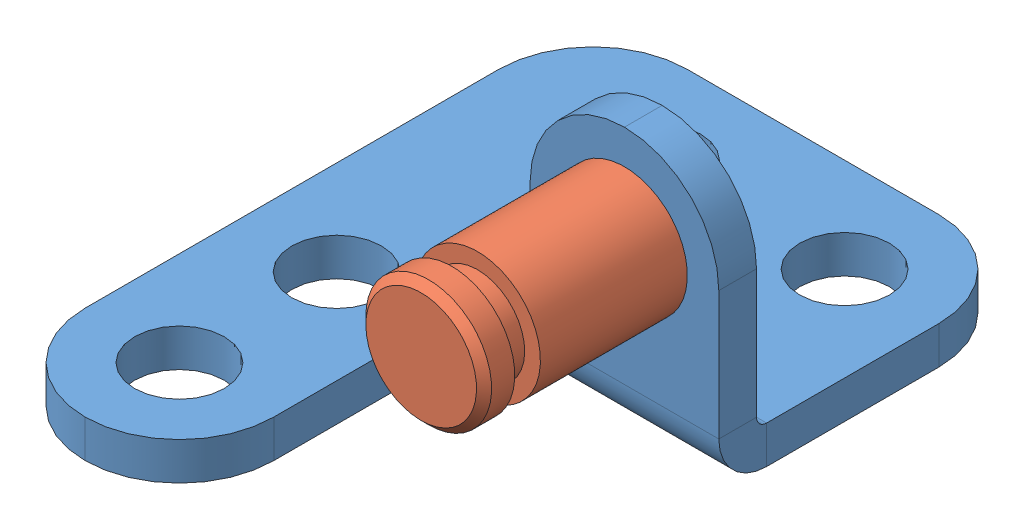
SolidWorks assembly Assem1.sldasm, configuration Default (file format 6000). Lengths in mm.
Overall size (22.23 13.67 30.4).
2 component instances, 2 part files, 2 mates.
Components (placement in the parent):
- Slingshot Pivot Bkt Mirror-1: Slingshot Pivot Bkt Mirror.SLDPRT [Default] at origin size (22.23 13.67 30.4)
- Slingshot Pivot Stud-1: Slingshot Pivot Stud.SLDPRT [Default] at (17.4625 6.858 15.875) x (0.708043 0.706169 0) z (0 0 1) size (6.35 6.35 12.65)
Mates (geometry in assembly coordinates):
- Concentric1: concentric: cylinder of Slingshot Pivot Bkt Mirror-1 through (17.4625 6.858 13.97) axis (0 0 1) radius 2.3813; cylinder of Slingshot Pivot Stud-1 through (17.4625 6.858 13.4874) axis (0 0 1) radius 2.7813
- Coincident1: coincident anti-aligned: plane of Slingshot Pivot Bkt Mirror-1 through (0 0 15.875) normal (0 0 1); plane of Slingshot Pivot Stud-1 through (17.4625 6.858 15.875) normal (0 0 -1)
